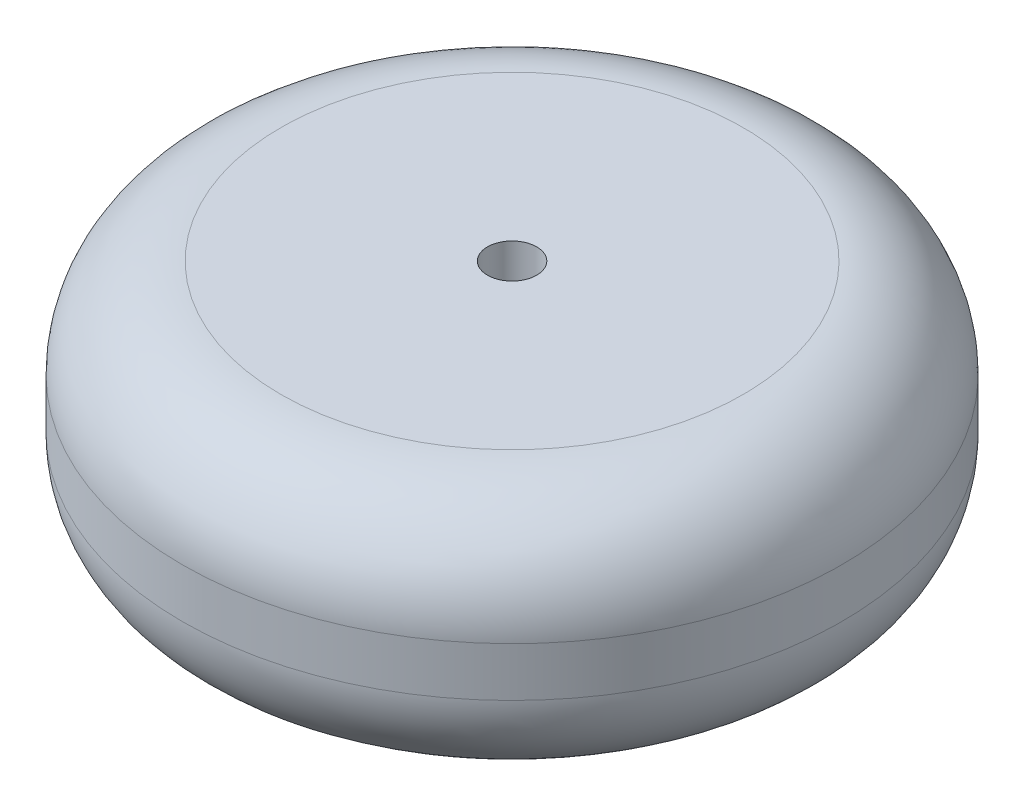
ISO-10303-21;
HEADER;
FILE_DESCRIPTION(('STEP AP214'),'2;1');
FILE_NAME('part.step','',(''),(''),'','','');
FILE_SCHEMA(('AUTOMOTIVE_DESIGN { 1 0 10303 214 1 1 1 1 }'));
ENDSEC;
DATA;
#1=APPLICATION_CONTEXT('core data for automotive mechanical design processes');
#2=APPLICATION_PROTOCOL_DEFINITION('international standard','automotive_design',2000,#1);
#3=PRODUCT_CONTEXT('',#1,'mechanical');
#4=PRODUCT('Part','Part','',(#3));
#5=PRODUCT_RELATED_PRODUCT_CATEGORY('part','',(#4));
#6=PRODUCT_DEFINITION_FORMATION('','',#4);
#7=PRODUCT_DEFINITION_CONTEXT('part definition',#1,'design');
#8=PRODUCT_DEFINITION('design','',#6,#7);
#9=PRODUCT_DEFINITION_SHAPE('','',#8);
#10=(LENGTH_UNIT() NAMED_UNIT(*) SI_UNIT(.MILLI.,.METRE.));
#11=(NAMED_UNIT(*) PLANE_ANGLE_UNIT() SI_UNIT($,.RADIAN.));
#12=(NAMED_UNIT(*) SI_UNIT($,.STERADIAN.) SOLID_ANGLE_UNIT());
#13=UNCERTAINTY_MEASURE_WITH_UNIT(LENGTH_MEASURE(1.E-05),#10,'distance_accuracy_value','');
#14=(GEOMETRIC_REPRESENTATION_CONTEXT(3) GLOBAL_UNCERTAINTY_ASSIGNED_CONTEXT((#13)) GLOBAL_UNIT_ASSIGNED_CONTEXT((#10,
#11,#12)) REPRESENTATION_CONTEXT('',''));
#15=CARTESIAN_POINT('',(0.,0.,0.));
#16=DIRECTION('',(0.,0.,1.));
#17=DIRECTION('',(1.,0.,0.));
#18=AXIS2_PLACEMENT_3D('',#15,#16,#17);
#19=CARTESIAN_POINT('',(0.,25.,0.));
#20=DIRECTION('',(0.,-1.,0.));
#21=DIRECTION('',(0.,0.,-1.));
#22=AXIS2_PLACEMENT_3D('',#19,#20,#21);
#23=CYLINDRICAL_SURFACE('',#22,33.5);
#24=CARTESIAN_POINT('',(0.,10.,0.));
#25=DIRECTION('',(0.,1.,0.));
#26=DIRECTION('',(0.,0.,1.));
#27=AXIS2_PLACEMENT_3D('',#24,#25,#26);
#28=CIRCLE('',#27,33.5);
#29=CARTESIAN_POINT('',(0.,10.,33.5));
#30=VERTEX_POINT('',#29);
#31=EDGE_CURVE('E49',#30,#30,#28,.T.);
#32=ORIENTED_EDGE('',*,*,#31,.T.);
#33=EDGE_LOOP('',(#32));
#34=FACE_BOUND('',#33,.T.);
#35=CARTESIAN_POINT('',(0.,15.,0.));
#36=DIRECTION('',(0.,1.,0.));
#37=DIRECTION('',(0.,0.,1.));
#38=AXIS2_PLACEMENT_3D('',#35,#36,#37);
#39=CIRCLE('',#38,33.5);
#40=CARTESIAN_POINT('',(0.,15.,33.5));
#41=VERTEX_POINT('',#40);
#42=EDGE_CURVE('E54',#41,#41,#39,.F.);
#43=ORIENTED_EDGE('',*,*,#42,.T.);
#44=EDGE_LOOP('',(#43));
#45=FACE_BOUND('',#44,.T.);
#46=ADVANCED_FACE('F36',(#34,#45),#23,.T.);
#47=CARTESIAN_POINT('',(0.,25.,0.));
#48=DIRECTION('',(0.,1.,0.));
#49=DIRECTION('',(0.,0.,1.));
#50=AXIS2_PLACEMENT_3D('',#47,#48,#49);
#51=PLANE('',#50);
#52=CARTESIAN_POINT('',(0.,25.,0.));
#53=DIRECTION('',(0.,1.,0.));
#54=DIRECTION('',(0.,0.,1.));
#55=AXIS2_PLACEMENT_3D('',#52,#53,#54);
#56=CIRCLE('',#55,2.5);
#57=CARTESIAN_POINT('',(0.,25.,2.5));
#58=VERTEX_POINT('',#57);
#59=EDGE_CURVE('E61',#58,#58,#56,.T.);
#60=ORIENTED_EDGE('',*,*,#59,.F.);
#61=EDGE_LOOP('',(#60));
#62=FACE_BOUND('',#61,.T.);
#63=CARTESIAN_POINT('',(0.,25.,0.));
#64=DIRECTION('',(0.,1.,0.));
#65=DIRECTION('',(0.,0.,1.));
#66=AXIS2_PLACEMENT_3D('',#63,#64,#65);
#67=CIRCLE('',#66,23.5);
#68=CARTESIAN_POINT('',(0.,25.,23.5));
#69=VERTEX_POINT('',#68);
#70=EDGE_CURVE('E10',#69,#69,#67,.T.);
#71=ORIENTED_EDGE('',*,*,#70,.T.);
#72=EDGE_LOOP('',(#71));
#73=FACE_BOUND('',#72,.T.);
#74=ADVANCED_FACE('F77',(#62,#73),#51,.T.);
#75=CARTESIAN_POINT('',(0.,0.,0.));
#76=DIRECTION('',(0.,1.,0.));
#77=DIRECTION('',(0.,0.,1.));
#78=AXIS2_PLACEMENT_3D('',#75,#76,#77);
#79=PLANE('',#78);
#80=CARTESIAN_POINT('',(0.,0.,0.));
#81=DIRECTION('',(0.,1.,0.));
#82=DIRECTION('',(0.,0.,1.));
#83=AXIS2_PLACEMENT_3D('',#80,#81,#82);
#84=CIRCLE('',#83,23.5);
#85=CARTESIAN_POINT('',(0.,0.,23.5));
#86=VERTEX_POINT('',#85);
#87=EDGE_CURVE('E44',#86,#86,#84,.F.);
#88=ORIENTED_EDGE('',*,*,#87,.T.);
#89=EDGE_LOOP('',(#88));
#90=FACE_BOUND('',#89,.T.);
#91=ADVANCED_FACE('F79',(#90),#79,.F.);
#92=CARTESIAN_POINT('',(0.,10.,0.));
#93=DIRECTION('',(0.,1.,0.));
#94=DIRECTION('',(0.,0.,1.));
#95=AXIS2_PLACEMENT_3D('',#92,#93,#94);
#96=TOROIDAL_SURFACE('',#95,23.5,10.);
#97=ORIENTED_EDGE('',*,*,#87,.F.);
#98=EDGE_LOOP('',(#97));
#99=FACE_BOUND('',#98,.T.);
#100=ORIENTED_EDGE('',*,*,#31,.F.);
#101=EDGE_LOOP('',(#100));
#102=FACE_BOUND('',#101,.T.);
#103=ADVANCED_FACE('F86',(#99,#102),#96,.T.);
#104=CARTESIAN_POINT('',(0.,15.,0.));
#105=DIRECTION('',(0.,1.,0.));
#106=DIRECTION('',(0.,0.,1.));
#107=AXIS2_PLACEMENT_3D('',#104,#105,#106);
#108=TOROIDAL_SURFACE('',#107,23.5,10.);
#109=ORIENTED_EDGE('',*,*,#42,.F.);
#110=EDGE_LOOP('',(#109));
#111=FACE_BOUND('',#110,.T.);
#112=ORIENTED_EDGE('',*,*,#70,.F.);
#113=EDGE_LOOP('',(#112));
#114=FACE_BOUND('',#113,.T.);
#115=ADVANCED_FACE('F38',(#111,#114),#108,.T.);
#116=CARTESIAN_POINT('',(0.,17.,0.));
#117=DIRECTION('',(0.,1.,0.));
#118=DIRECTION('',(0.,0.,1.));
#119=AXIS2_PLACEMENT_3D('',#116,#117,#118);
#120=CYLINDRICAL_SURFACE('',#119,2.5);
#121=CARTESIAN_POINT('',(0.,17.,0.));
#122=DIRECTION('',(0.,1.,0.));
#123=DIRECTION('',(0.,0.,1.));
#124=AXIS2_PLACEMENT_3D('',#121,#122,#123);
#125=CIRCLE('',#124,2.5);
#126=CARTESIAN_POINT('',(0.,17.,2.5));
#127=VERTEX_POINT('',#126);
#128=EDGE_CURVE('E60',#127,#127,#125,.T.);
#129=ORIENTED_EDGE('',*,*,#128,.F.);
#130=EDGE_LOOP('',(#129));
#131=FACE_BOUND('',#130,.T.);
#132=ORIENTED_EDGE('',*,*,#59,.T.);
#133=EDGE_LOOP('',(#132));
#134=FACE_BOUND('',#133,.T.);
#135=ADVANCED_FACE('F71',(#131,#134),#120,.F.);
#136=CARTESIAN_POINT('',(0.,17.,0.));
#137=DIRECTION('',(0.,1.,0.));
#138=DIRECTION('',(0.,0.,1.));
#139=AXIS2_PLACEMENT_3D('',#136,#137,#138);
#140=PLANE('',#139);
#141=ORIENTED_EDGE('',*,*,#128,.T.);
#142=EDGE_LOOP('',(#141));
#143=FACE_BOUND('',#142,.T.);
#144=ADVANCED_FACE('F69',(#143),#140,.T.);
#145=CLOSED_SHELL('',(#46,#74,#91,#103,#115,#135,#144));
#146=MANIFOLD_SOLID_BREP('B2',#145);
#147=ADVANCED_BREP_SHAPE_REPRESENTATION('',(#18,#146),#14);
#148=SHAPE_DEFINITION_REPRESENTATION(#9,#147);
ENDSEC;
END-ISO-10303-21;
